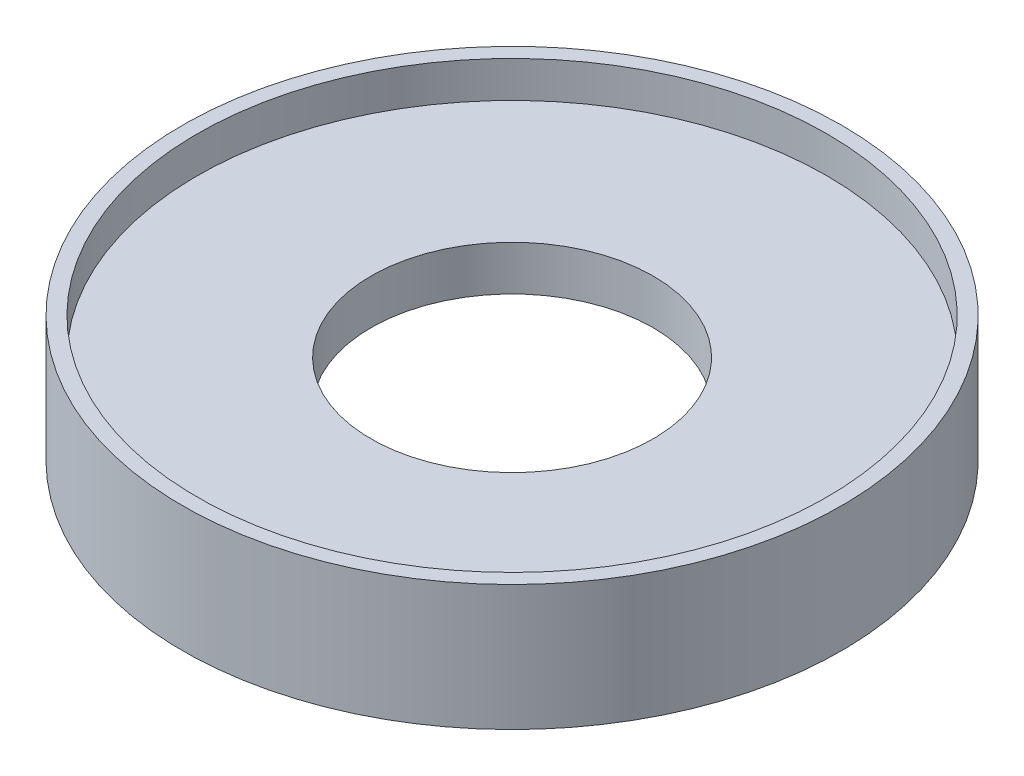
from build123d import *


with BuildPart() as part:
    # Sketch1 → Revolve1 (revolve)
    with BuildSketch(Plane(origin=(0, 0, 0), x_dir=(0, 0, -1), z_dir=(1, 0, 0))):
        Polygon((19.05, 0), (42.5, 0), (42.5, -6), (44.5, -6), (44.5, 10.96), (42.5, 10.96), (42.5, 6.05), (19.05, 6.05), align=None)
    revolve(axis=Axis((0, 0, 0), (0, 1, 0)))


solid = part.part
